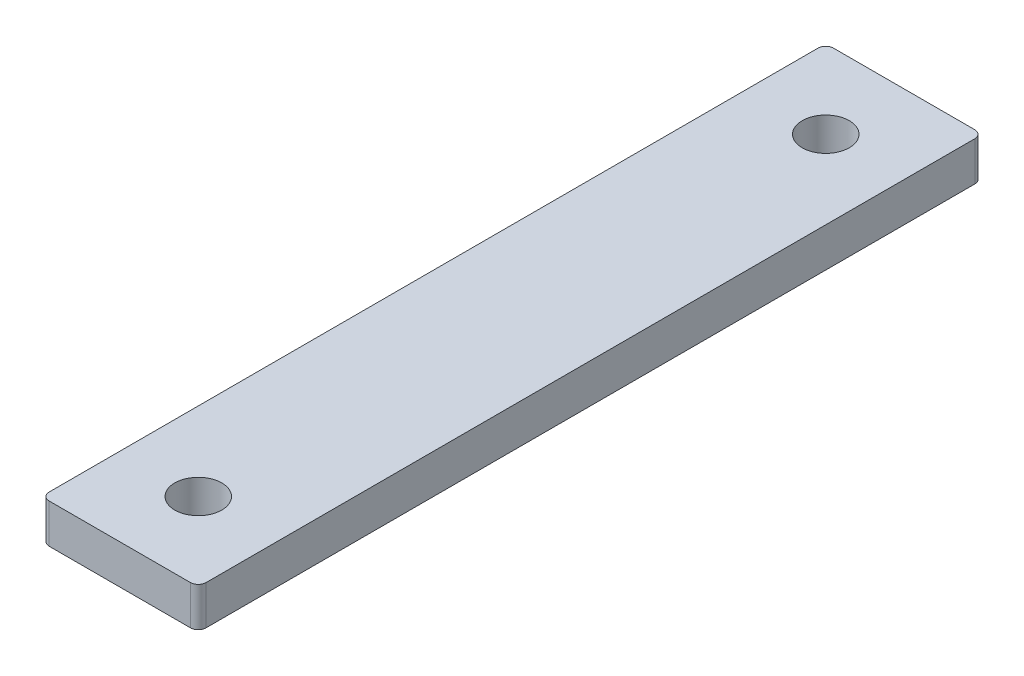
ISO-10303-21;
HEADER;
FILE_DESCRIPTION(('STEP AP214'),'2;1');
FILE_NAME('part.step','',(''),(''),'','','');
FILE_SCHEMA(('AUTOMOTIVE_DESIGN { 1 0 10303 214 1 1 1 1 }'));
ENDSEC;
DATA;
#1=APPLICATION_CONTEXT('core data for automotive mechanical design processes');
#2=APPLICATION_PROTOCOL_DEFINITION('international standard','automotive_design',2000,#1);
#3=PRODUCT_CONTEXT('',#1,'mechanical');
#4=PRODUCT('Part','Part','',(#3));
#5=PRODUCT_RELATED_PRODUCT_CATEGORY('part','',(#4));
#6=PRODUCT_DEFINITION_FORMATION('','',#4);
#7=PRODUCT_DEFINITION_CONTEXT('part definition',#1,'design');
#8=PRODUCT_DEFINITION('design','',#6,#7);
#9=PRODUCT_DEFINITION_SHAPE('','',#8);
#10=(LENGTH_UNIT() NAMED_UNIT(*) SI_UNIT(.MILLI.,.METRE.));
#11=(NAMED_UNIT(*) PLANE_ANGLE_UNIT() SI_UNIT($,.RADIAN.));
#12=(NAMED_UNIT(*) SI_UNIT($,.STERADIAN.) SOLID_ANGLE_UNIT());
#13=UNCERTAINTY_MEASURE_WITH_UNIT(LENGTH_MEASURE(1.E-05),#10,'distance_accuracy_value','');
#14=(GEOMETRIC_REPRESENTATION_CONTEXT(3) GLOBAL_UNCERTAINTY_ASSIGNED_CONTEXT((#13)) GLOBAL_UNIT_ASSIGNED_CONTEXT((#10,
#11,#12)) REPRESENTATION_CONTEXT('',''));
#15=CARTESIAN_POINT('',(0.,0.,0.));
#16=DIRECTION('',(0.,0.,1.));
#17=DIRECTION('',(1.,0.,0.));
#18=AXIS2_PLACEMENT_3D('',#15,#16,#17);
#19=CARTESIAN_POINT('',(0.,5.,0.));
#20=DIRECTION('',(0.,-1.,0.));
#21=DIRECTION('',(0.,0.,-1.));
#22=AXIS2_PLACEMENT_3D('',#19,#20,#21);
#23=PLANE('',#22);
#24=CARTESIAN_POINT('',(10.,5.,-10.));
#25=DIRECTION('',(0.,1.,0.));
#26=DIRECTION('',(0.,0.,1.));
#27=AXIS2_PLACEMENT_3D('',#24,#25,#26);
#28=CIRCLE('',#27,3.);
#29=CARTESIAN_POINT('',(10.,5.,-7.));
#30=VERTEX_POINT('',#29);
#31=EDGE_CURVE('E129',#30,#30,#28,.T.);
#32=ORIENTED_EDGE('',*,*,#31,.F.);
#33=EDGE_LOOP('',(#32));
#34=FACE_BOUND('',#33,.T.);
#35=DIRECTION('',(-1.,0.,0.));
#36=VECTOR('',#35,1.);
#37=CARTESIAN_POINT('',(0.,5.,-100.));
#38=LINE('',#37,#36);
#39=CARTESIAN_POINT('',(19.,5.,-100.));
#40=VERTEX_POINT('',#39);
#41=CARTESIAN_POINT('',(1.,5.,-100.));
#42=VERTEX_POINT('',#41);
#43=EDGE_CURVE('E138',#40,#42,#38,.T.);
#44=ORIENTED_EDGE('',*,*,#43,.T.);
#45=CARTESIAN_POINT('',(1.,5.,-99.));
#46=DIRECTION('',(0.,-1.,0.));
#47=DIRECTION('',(0.,0.,-1.));
#48=AXIS2_PLACEMENT_3D('',#45,#46,#47);
#49=CIRCLE('',#48,1.);
#50=CARTESIAN_POINT('',(0.,5.,-99.));
#51=VERTEX_POINT('',#50);
#52=EDGE_CURVE('E156',#42,#51,#49,.F.);
#53=ORIENTED_EDGE('',*,*,#52,.T.);
#54=DIRECTION('',(0.,0.,1.));
#55=VECTOR('',#54,1.);
#56=CARTESIAN_POINT('',(0.,5.,0.));
#57=LINE('',#56,#55);
#58=CARTESIAN_POINT('',(0.,5.,-1.));
#59=VERTEX_POINT('',#58);
#60=EDGE_CURVE('E120',#51,#59,#57,.T.);
#61=ORIENTED_EDGE('',*,*,#60,.T.);
#62=CARTESIAN_POINT('',(1.,5.,-1.));
#63=DIRECTION('',(0.,-1.,0.));
#64=DIRECTION('',(0.,0.,-1.));
#65=AXIS2_PLACEMENT_3D('',#62,#63,#64);
#66=CIRCLE('',#65,1.);
#67=CARTESIAN_POINT('',(1.,5.,0.));
#68=VERTEX_POINT('',#67);
#69=EDGE_CURVE('E152',#59,#68,#66,.F.);
#70=ORIENTED_EDGE('',*,*,#69,.T.);
#71=DIRECTION('',(1.,0.,0.));
#72=VECTOR('',#71,1.);
#73=CARTESIAN_POINT('',(0.,5.,0.));
#74=LINE('',#73,#72);
#75=CARTESIAN_POINT('',(19.,5.,0.));
#76=VERTEX_POINT('',#75);
#77=EDGE_CURVE('E165',#68,#76,#74,.T.);
#78=ORIENTED_EDGE('',*,*,#77,.T.);
#79=CARTESIAN_POINT('',(19.,5.,-1.));
#80=DIRECTION('',(0.,-1.,0.));
#81=DIRECTION('',(0.,0.,-1.));
#82=AXIS2_PLACEMENT_3D('',#79,#80,#81);
#83=CIRCLE('',#82,1.);
#84=CARTESIAN_POINT('',(20.,5.,-1.));
#85=VERTEX_POINT('',#84);
#86=EDGE_CURVE('E55',#76,#85,#83,.F.);
#87=ORIENTED_EDGE('',*,*,#86,.T.);
#88=DIRECTION('',(0.,0.,-1.));
#89=VECTOR('',#88,1.);
#90=CARTESIAN_POINT('',(20.,5.,0.));
#91=LINE('',#90,#89);
#92=CARTESIAN_POINT('',(20.,5.,-99.));
#93=VERTEX_POINT('',#92);
#94=EDGE_CURVE('E171',#85,#93,#91,.T.);
#95=ORIENTED_EDGE('',*,*,#94,.T.);
#96=CARTESIAN_POINT('',(19.,5.,-99.));
#97=DIRECTION('',(0.,-1.,0.));
#98=DIRECTION('',(0.,0.,-1.));
#99=AXIS2_PLACEMENT_3D('',#96,#97,#98);
#100=CIRCLE('',#99,1.);
#101=EDGE_CURVE('E154',#93,#40,#100,.F.);
#102=ORIENTED_EDGE('',*,*,#101,.T.);
#103=EDGE_LOOP('',(#44,#53,#61,#70,#78,#87,#95,#102));
#104=FACE_BOUND('',#103,.T.);
#105=CARTESIAN_POINT('',(10.,5.,-90.));
#106=DIRECTION('',(0.,1.,0.));
#107=DIRECTION('',(0.,0.,1.));
#108=AXIS2_PLACEMENT_3D('',#105,#106,#107);
#109=CIRCLE('',#108,3.);
#110=CARTESIAN_POINT('',(10.,5.,-87.));
#111=VERTEX_POINT('',#110);
#112=EDGE_CURVE('E186',#111,#111,#109,.T.);
#113=ORIENTED_EDGE('',*,*,#112,.F.);
#114=EDGE_LOOP('',(#113));
#115=FACE_BOUND('',#114,.T.);
#116=ADVANCED_FACE('F33',(#34,#104,#115),#23,.F.);
#117=CARTESIAN_POINT('',(0.,0.,0.));
#118=DIRECTION('',(0.,-1.,0.));
#119=DIRECTION('',(0.,0.,-1.));
#120=AXIS2_PLACEMENT_3D('',#117,#118,#119);
#121=PLANE('',#120);
#122=CARTESIAN_POINT('',(10.,0.,-10.));
#123=DIRECTION('',(0.,1.,0.));
#124=DIRECTION('',(0.,0.,1.));
#125=AXIS2_PLACEMENT_3D('',#122,#123,#124);
#126=CIRCLE('',#125,3.);
#127=CARTESIAN_POINT('',(10.,0.,-7.));
#128=VERTEX_POINT('',#127);
#129=EDGE_CURVE('E135',#128,#128,#126,.T.);
#130=ORIENTED_EDGE('',*,*,#129,.T.);
#131=EDGE_LOOP('',(#130));
#132=FACE_BOUND('',#131,.T.);
#133=DIRECTION('',(0.,0.,1.));
#134=VECTOR('',#133,1.);
#135=CARTESIAN_POINT('',(0.,0.,0.));
#136=LINE('',#135,#134);
#137=CARTESIAN_POINT('',(0.,0.,-99.));
#138=VERTEX_POINT('',#137);
#139=CARTESIAN_POINT('',(0.,0.,-1.));
#140=VERTEX_POINT('',#139);
#141=EDGE_CURVE('E117',#138,#140,#136,.T.);
#142=ORIENTED_EDGE('',*,*,#141,.F.);
#143=CARTESIAN_POINT('',(1.,0.,-99.));
#144=DIRECTION('',(0.,-1.,0.));
#145=DIRECTION('',(0.,0.,-1.));
#146=AXIS2_PLACEMENT_3D('',#143,#144,#145);
#147=CIRCLE('',#146,1.);
#148=CARTESIAN_POINT('',(1.,0.,-100.));
#149=VERTEX_POINT('',#148);
#150=EDGE_CURVE('E100',#138,#149,#147,.T.);
#151=ORIENTED_EDGE('',*,*,#150,.T.);
#152=DIRECTION('',(-1.,0.,0.));
#153=VECTOR('',#152,1.);
#154=CARTESIAN_POINT('',(0.,0.,-100.));
#155=LINE('',#154,#153);
#156=CARTESIAN_POINT('',(19.,0.,-100.));
#157=VERTEX_POINT('',#156);
#158=EDGE_CURVE('E142',#157,#149,#155,.T.);
#159=ORIENTED_EDGE('',*,*,#158,.F.);
#160=CARTESIAN_POINT('',(19.,0.,-99.));
#161=DIRECTION('',(0.,-1.,0.));
#162=DIRECTION('',(0.,0.,-1.));
#163=AXIS2_PLACEMENT_3D('',#160,#161,#162);
#164=CIRCLE('',#163,1.);
#165=CARTESIAN_POINT('',(20.,0.,-99.));
#166=VERTEX_POINT('',#165);
#167=EDGE_CURVE('E111',#157,#166,#164,.T.);
#168=ORIENTED_EDGE('',*,*,#167,.T.);
#169=DIRECTION('',(0.,0.,-1.));
#170=VECTOR('',#169,1.);
#171=CARTESIAN_POINT('',(20.,0.,0.));
#172=LINE('',#171,#170);
#173=CARTESIAN_POINT('',(20.,0.,-1.));
#174=VERTEX_POINT('',#173);
#175=EDGE_CURVE('E132',#174,#166,#172,.T.);
#176=ORIENTED_EDGE('',*,*,#175,.F.);
#177=CARTESIAN_POINT('',(19.,0.,-1.));
#178=DIRECTION('',(0.,-1.,0.));
#179=DIRECTION('',(0.,0.,-1.));
#180=AXIS2_PLACEMENT_3D('',#177,#178,#179);
#181=CIRCLE('',#180,1.);
#182=CARTESIAN_POINT('',(19.,0.,0.));
#183=VERTEX_POINT('',#182);
#184=EDGE_CURVE('E121',#174,#183,#181,.T.);
#185=ORIENTED_EDGE('',*,*,#184,.T.);
#186=DIRECTION('',(1.,0.,0.));
#187=VECTOR('',#186,1.);
#188=CARTESIAN_POINT('',(0.,0.,0.));
#189=LINE('',#188,#187);
#190=CARTESIAN_POINT('',(1.,0.,0.));
#191=VERTEX_POINT('',#190);
#192=EDGE_CURVE('E128',#191,#183,#189,.T.);
#193=ORIENTED_EDGE('',*,*,#192,.F.);
#194=CARTESIAN_POINT('',(1.,0.,-1.));
#195=DIRECTION('',(0.,-1.,0.));
#196=DIRECTION('',(0.,0.,-1.));
#197=AXIS2_PLACEMENT_3D('',#194,#195,#196);
#198=CIRCLE('',#197,1.);
#199=EDGE_CURVE('E127',#191,#140,#198,.T.);
#200=ORIENTED_EDGE('',*,*,#199,.T.);
#201=EDGE_LOOP('',(#142,#151,#159,#168,#176,#185,#193,#200));
#202=FACE_BOUND('',#201,.T.);
#203=CARTESIAN_POINT('',(10.,0.,-90.));
#204=DIRECTION('',(0.,1.,0.));
#205=DIRECTION('',(0.,0.,1.));
#206=AXIS2_PLACEMENT_3D('',#203,#204,#205);
#207=CIRCLE('',#206,3.);
#208=CARTESIAN_POINT('',(10.,0.,-87.));
#209=VERTEX_POINT('',#208);
#210=EDGE_CURVE('E188',#209,#209,#207,.T.);
#211=ORIENTED_EDGE('',*,*,#210,.T.);
#212=EDGE_LOOP('',(#211));
#213=FACE_BOUND('',#212,.T.);
#214=ADVANCED_FACE('F124',(#132,#202,#213),#121,.T.);
#215=CARTESIAN_POINT('',(0.,5.,0.));
#216=DIRECTION('',(1.,0.,0.));
#217=DIRECTION('',(0.,0.,-1.));
#218=AXIS2_PLACEMENT_3D('',#215,#216,#217);
#219=PLANE('',#218);
#220=ORIENTED_EDGE('',*,*,#60,.F.);
#221=DIRECTION('',(0.,-1.,0.));
#222=VECTOR('',#221,1.);
#223=CARTESIAN_POINT('',(0.,5.,-99.));
#224=LINE('',#223,#222);
#225=EDGE_CURVE('E104',#51,#138,#224,.T.);
#226=ORIENTED_EDGE('',*,*,#225,.T.);
#227=ORIENTED_EDGE('',*,*,#141,.T.);
#228=DIRECTION('',(0.,-1.,0.));
#229=VECTOR('',#228,1.);
#230=CARTESIAN_POINT('',(0.,5.,-1.));
#231=LINE('',#230,#229);
#232=EDGE_CURVE('E122',#140,#59,#231,.F.);
#233=ORIENTED_EDGE('',*,*,#232,.T.);
#234=EDGE_LOOP('',(#220,#226,#227,#233));
#235=FACE_BOUND('',#234,.T.);
#236=ADVANCED_FACE('F116',(#235),#219,.F.);
#237=CARTESIAN_POINT('',(0.,5.,0.));
#238=DIRECTION('',(0.,0.,-1.));
#239=DIRECTION('',(-1.,0.,0.));
#240=AXIS2_PLACEMENT_3D('',#237,#238,#239);
#241=PLANE('',#240);
#242=ORIENTED_EDGE('',*,*,#77,.F.);
#243=DIRECTION('',(0.,-1.,0.));
#244=VECTOR('',#243,1.);
#245=CARTESIAN_POINT('',(1.,5.,0.));
#246=LINE('',#245,#244);
#247=EDGE_CURVE('E11',#68,#191,#246,.T.);
#248=ORIENTED_EDGE('',*,*,#247,.T.);
#249=ORIENTED_EDGE('',*,*,#192,.T.);
#250=DIRECTION('',(0.,-1.,0.));
#251=VECTOR('',#250,1.);
#252=CARTESIAN_POINT('',(19.,5.,0.));
#253=LINE('',#252,#251);
#254=EDGE_CURVE('E41',#183,#76,#253,.F.);
#255=ORIENTED_EDGE('',*,*,#254,.T.);
#256=EDGE_LOOP('',(#242,#248,#249,#255));
#257=FACE_BOUND('',#256,.T.);
#258=ADVANCED_FACE('F164',(#257),#241,.F.);
#259=CARTESIAN_POINT('',(20.,5.,0.));
#260=DIRECTION('',(-1.,0.,0.));
#261=DIRECTION('',(0.,0.,1.));
#262=AXIS2_PLACEMENT_3D('',#259,#260,#261);
#263=PLANE('',#262);
#264=ORIENTED_EDGE('',*,*,#175,.T.);
#265=DIRECTION('',(0.,-1.,0.));
#266=VECTOR('',#265,1.);
#267=CARTESIAN_POINT('',(20.,5.,-99.));
#268=LINE('',#267,#266);
#269=EDGE_CURVE('E48',#166,#93,#268,.F.);
#270=ORIENTED_EDGE('',*,*,#269,.T.);
#271=ORIENTED_EDGE('',*,*,#94,.F.);
#272=DIRECTION('',(0.,-1.,0.));
#273=VECTOR('',#272,1.);
#274=CARTESIAN_POINT('',(20.,5.,-1.));
#275=LINE('',#274,#273);
#276=EDGE_CURVE('E158',#85,#174,#275,.T.);
#277=ORIENTED_EDGE('',*,*,#276,.T.);
#278=EDGE_LOOP('',(#264,#270,#271,#277));
#279=FACE_BOUND('',#278,.T.);
#280=ADVANCED_FACE('F175',(#279),#263,.F.);
#281=CARTESIAN_POINT('',(0.,5.,-100.));
#282=DIRECTION('',(0.,0.,1.));
#283=DIRECTION('',(1.,0.,0.));
#284=AXIS2_PLACEMENT_3D('',#281,#282,#283);
#285=PLANE('',#284);
#286=ORIENTED_EDGE('',*,*,#158,.T.);
#287=DIRECTION('',(0.,-1.,0.));
#288=VECTOR('',#287,1.);
#289=CARTESIAN_POINT('',(1.,5.,-100.));
#290=LINE('',#289,#288);
#291=EDGE_CURVE('E105',#149,#42,#290,.F.);
#292=ORIENTED_EDGE('',*,*,#291,.T.);
#293=ORIENTED_EDGE('',*,*,#43,.F.);
#294=DIRECTION('',(0.,-1.,0.));
#295=VECTOR('',#294,1.);
#296=CARTESIAN_POINT('',(19.,5.,-100.));
#297=LINE('',#296,#295);
#298=EDGE_CURVE('E110',#40,#157,#297,.T.);
#299=ORIENTED_EDGE('',*,*,#298,.T.);
#300=EDGE_LOOP('',(#286,#292,#293,#299));
#301=FACE_BOUND('',#300,.T.);
#302=ADVANCED_FACE('F182',(#301),#285,.F.);
#303=CARTESIAN_POINT('',(10.,5.,-10.));
#304=DIRECTION('',(0.,-1.,0.));
#305=DIRECTION('',(0.,0.,-1.));
#306=AXIS2_PLACEMENT_3D('',#303,#304,#305);
#307=CYLINDRICAL_SURFACE('',#306,3.);
#308=ORIENTED_EDGE('',*,*,#31,.T.);
#309=EDGE_LOOP('',(#308));
#310=FACE_BOUND('',#309,.T.);
#311=ORIENTED_EDGE('',*,*,#129,.F.);
#312=EDGE_LOOP('',(#311));
#313=FACE_BOUND('',#312,.T.);
#314=ADVANCED_FACE('F207',(#310,#313),#307,.F.);
#315=CARTESIAN_POINT('',(10.,5.,-90.));
#316=DIRECTION('',(0.,-1.,0.));
#317=DIRECTION('',(0.,0.,-1.));
#318=AXIS2_PLACEMENT_3D('',#315,#316,#317);
#319=CYLINDRICAL_SURFACE('',#318,3.);
#320=ORIENTED_EDGE('',*,*,#112,.T.);
#321=EDGE_LOOP('',(#320));
#322=FACE_BOUND('',#321,.T.);
#323=ORIENTED_EDGE('',*,*,#210,.F.);
#324=EDGE_LOOP('',(#323));
#325=FACE_BOUND('',#324,.T.);
#326=ADVANCED_FACE('F194',(#322,#325),#319,.F.);
#327=CARTESIAN_POINT('',(1.,5.,-99.));
#328=DIRECTION('',(0.,-1.,0.));
#329=DIRECTION('',(0.,0.,-1.));
#330=AXIS2_PLACEMENT_3D('',#327,#328,#329);
#331=CYLINDRICAL_SURFACE('',#330,1.);
#332=ORIENTED_EDGE('',*,*,#52,.F.);
#333=ORIENTED_EDGE('',*,*,#291,.F.);
#334=ORIENTED_EDGE('',*,*,#150,.F.);
#335=ORIENTED_EDGE('',*,*,#225,.F.);
#336=EDGE_LOOP('',(#332,#333,#334,#335));
#337=FACE_BOUND('',#336,.T.);
#338=ADVANCED_FACE('F103',(#337),#331,.T.);
#339=CARTESIAN_POINT('',(19.,5.,-99.));
#340=DIRECTION('',(0.,-1.,0.));
#341=DIRECTION('',(0.,0.,-1.));
#342=AXIS2_PLACEMENT_3D('',#339,#340,#341);
#343=CYLINDRICAL_SURFACE('',#342,1.);
#344=ORIENTED_EDGE('',*,*,#101,.F.);
#345=ORIENTED_EDGE('',*,*,#269,.F.);
#346=ORIENTED_EDGE('',*,*,#167,.F.);
#347=ORIENTED_EDGE('',*,*,#298,.F.);
#348=EDGE_LOOP('',(#344,#345,#346,#347));
#349=FACE_BOUND('',#348,.T.);
#350=ADVANCED_FACE('F179',(#349),#343,.T.);
#351=CARTESIAN_POINT('',(1.,5.,-1.));
#352=DIRECTION('',(0.,-1.,0.));
#353=DIRECTION('',(0.,0.,-1.));
#354=AXIS2_PLACEMENT_3D('',#351,#352,#353);
#355=CYLINDRICAL_SURFACE('',#354,1.);
#356=ORIENTED_EDGE('',*,*,#69,.F.);
#357=ORIENTED_EDGE('',*,*,#232,.F.);
#358=ORIENTED_EDGE('',*,*,#199,.F.);
#359=ORIENTED_EDGE('',*,*,#247,.F.);
#360=EDGE_LOOP('',(#356,#357,#358,#359));
#361=FACE_BOUND('',#360,.T.);
#362=ADVANCED_FACE('F221',(#361),#355,.T.);
#363=CARTESIAN_POINT('',(19.,5.,-1.));
#364=DIRECTION('',(0.,-1.,0.));
#365=DIRECTION('',(0.,0.,-1.));
#366=AXIS2_PLACEMENT_3D('',#363,#364,#365);
#367=CYLINDRICAL_SURFACE('',#366,1.);
#368=ORIENTED_EDGE('',*,*,#86,.F.);
#369=ORIENTED_EDGE('',*,*,#254,.F.);
#370=ORIENTED_EDGE('',*,*,#184,.F.);
#371=ORIENTED_EDGE('',*,*,#276,.F.);
#372=EDGE_LOOP('',(#368,#369,#370,#371));
#373=FACE_BOUND('',#372,.T.);
#374=ADVANCED_FACE('F35',(#373),#367,.T.);
#375=CLOSED_SHELL('',(#116,#214,#236,#258,#280,#302,#314,#326,#338,#350,#362,#374));
#376=MANIFOLD_SOLID_BREP('B2',#375);
#377=ADVANCED_BREP_SHAPE_REPRESENTATION('',(#18,#376),#14);
#378=SHAPE_DEFINITION_REPRESENTATION(#9,#377);
ENDSEC;
END-ISO-10303-21;
